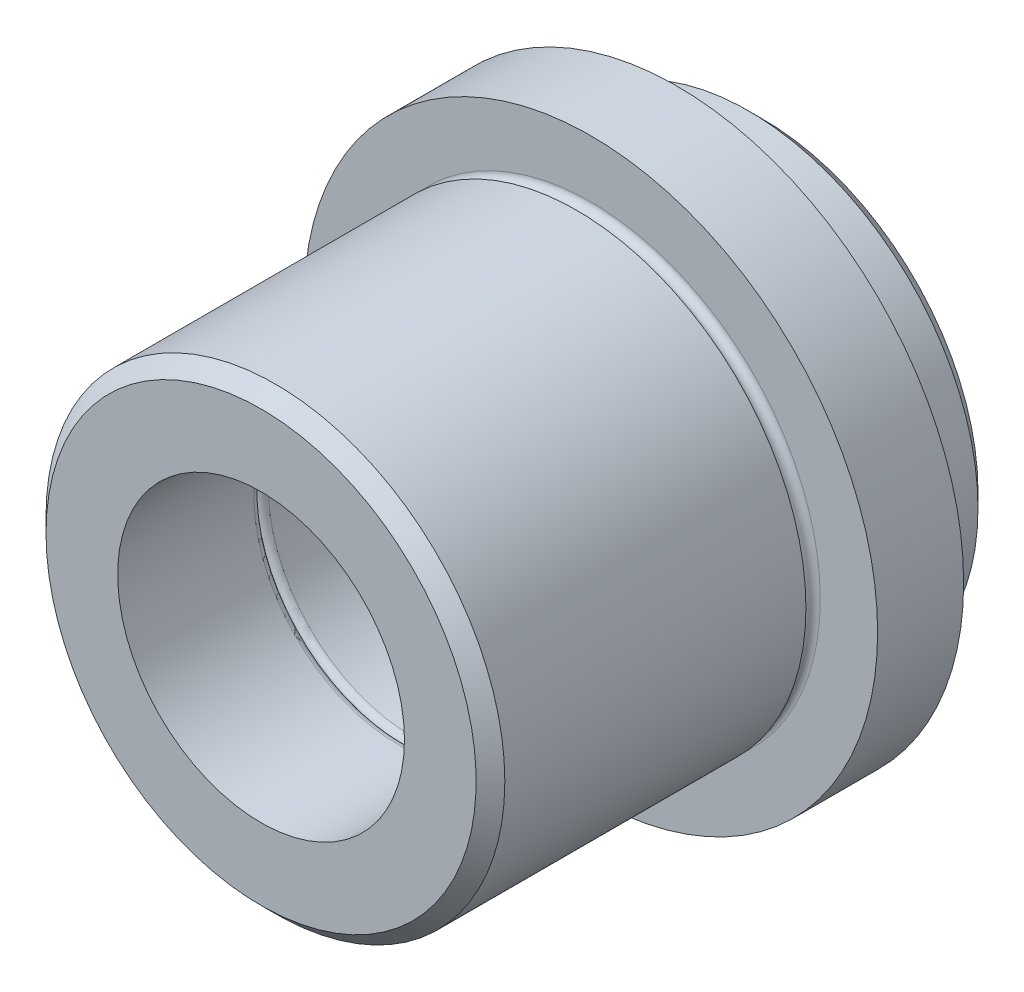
ISO-10303-21;
HEADER;
FILE_DESCRIPTION(('STEP AP214'),'2;1');
FILE_NAME('part.step','',(''),(''),'','','');
FILE_SCHEMA(('AUTOMOTIVE_DESIGN { 1 0 10303 214 1 1 1 1 }'));
ENDSEC;
DATA;
#1=APPLICATION_CONTEXT('core data for automotive mechanical design processes');
#2=APPLICATION_PROTOCOL_DEFINITION('international standard','automotive_design',2000,#1);
#3=PRODUCT_CONTEXT('',#1,'mechanical');
#4=PRODUCT('Part','Part','',(#3));
#5=PRODUCT_RELATED_PRODUCT_CATEGORY('part','',(#4));
#6=PRODUCT_DEFINITION_FORMATION('','',#4);
#7=PRODUCT_DEFINITION_CONTEXT('part definition',#1,'design');
#8=PRODUCT_DEFINITION('design','',#6,#7);
#9=PRODUCT_DEFINITION_SHAPE('','',#8);
#10=(LENGTH_UNIT() NAMED_UNIT(*) SI_UNIT(.MILLI.,.METRE.));
#11=(NAMED_UNIT(*) PLANE_ANGLE_UNIT() SI_UNIT($,.RADIAN.));
#12=(NAMED_UNIT(*) SI_UNIT($,.STERADIAN.) SOLID_ANGLE_UNIT());
#13=UNCERTAINTY_MEASURE_WITH_UNIT(LENGTH_MEASURE(1.E-05),#10,'distance_accuracy_value','');
#14=(GEOMETRIC_REPRESENTATION_CONTEXT(3) GLOBAL_UNCERTAINTY_ASSIGNED_CONTEXT((#13)) GLOBAL_UNIT_ASSIGNED_CONTEXT((#10,
#11,#12)) REPRESENTATION_CONTEXT('',''));
#15=CARTESIAN_POINT('',(0.,0.,0.));
#16=DIRECTION('',(0.,0.,1.));
#17=DIRECTION('',(1.,0.,0.));
#18=AXIS2_PLACEMENT_3D('',#15,#16,#17);
#19=CARTESIAN_POINT('',(0.,0.,0.));
#20=DIRECTION('',(0.,0.,1.));
#21=DIRECTION('',(1.,0.,0.));
#22=AXIS2_PLACEMENT_3D('',#19,#20,#21);
#23=CYLINDRICAL_SURFACE('',#22,10.);
#24=CARTESIAN_POINT('',(0.,0.,-9.5));
#25=DIRECTION('',(0.,0.,1.));
#26=DIRECTION('',(1.,0.,0.));
#27=AXIS2_PLACEMENT_3D('',#24,#25,#26);
#28=CIRCLE('',#27,10.);
#29=CARTESIAN_POINT('',(10.,0.,-9.5));
#30=VERTEX_POINT('',#29);
#31=EDGE_CURVE('E69',#30,#30,#28,.T.);
#32=ORIENTED_EDGE('',*,*,#31,.F.);
#33=EDGE_LOOP('',(#32));
#34=FACE_BOUND('',#33,.T.);
#35=CARTESIAN_POINT('',(0.,0.,0.));
#36=DIRECTION('',(0.,0.,1.));
#37=DIRECTION('',(1.,0.,0.));
#38=AXIS2_PLACEMENT_3D('',#35,#36,#37);
#39=CIRCLE('',#38,10.);
#40=CARTESIAN_POINT('',(10.,0.,0.));
#41=VERTEX_POINT('',#40);
#42=EDGE_CURVE('E33',#41,#41,#39,.T.);
#43=ORIENTED_EDGE('',*,*,#42,.T.);
#44=EDGE_LOOP('',(#43));
#45=FACE_BOUND('',#44,.T.);
#46=ADVANCED_FACE('F13',(#34,#45),#23,.F.);
#47=CARTESIAN_POINT('',(0.,10.,0.));
#48=DIRECTION('',(0.,0.,-1.));
#49=DIRECTION('',(-1.,0.,0.));
#50=AXIS2_PLACEMENT_3D('',#47,#48,#49);
#51=PLANE('',#50);
#52=CARTESIAN_POINT('',(0.,0.,0.));
#53=DIRECTION('',(0.,0.,-1.));
#54=DIRECTION('',(-1.,0.,0.));
#55=AXIS2_PLACEMENT_3D('',#52,#53,#54);
#56=CIRCLE('',#55,15.);
#57=CARTESIAN_POINT('',(-15.,0.,0.));
#58=VERTEX_POINT('',#57);
#59=EDGE_CURVE('E20',#58,#58,#56,.F.);
#60=ORIENTED_EDGE('',*,*,#59,.T.);
#61=EDGE_LOOP('',(#60));
#62=FACE_BOUND('',#61,.T.);
#63=ORIENTED_EDGE('',*,*,#42,.F.);
#64=EDGE_LOOP('',(#63));
#65=FACE_BOUND('',#64,.T.);
#66=ADVANCED_FACE('F77',(#62,#65),#51,.F.);
#67=CARTESIAN_POINT('',(0.,0.,0.));
#68=DIRECTION('',(0.,0.,1.));
#69=DIRECTION('',(1.,0.,0.));
#70=AXIS2_PLACEMENT_3D('',#67,#68,#69);
#71=CYLINDRICAL_SURFACE('',#70,16.);
#72=CARTESIAN_POINT('',(0.,0.,-1.00000000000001));
#73=DIRECTION('',(0.,0.,-1.));
#74=DIRECTION('',(-1.,0.,0.));
#75=AXIS2_PLACEMENT_3D('',#72,#73,#74);
#76=CIRCLE('',#75,16.);
#77=CARTESIAN_POINT('',(-16.,0.,-1.00000000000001));
#78=VERTEX_POINT('',#77);
#79=EDGE_CURVE('E8',#78,#78,#76,.T.);
#80=ORIENTED_EDGE('',*,*,#79,.T.);
#81=EDGE_LOOP('',(#80));
#82=FACE_BOUND('',#81,.T.);
#83=CARTESIAN_POINT('',(0.,0.,-22.));
#84=DIRECTION('',(0.,0.,1.));
#85=DIRECTION('',(1.,0.,0.));
#86=AXIS2_PLACEMENT_3D('',#83,#84,#85);
#87=CIRCLE('',#86,16.);
#88=CARTESIAN_POINT('',(16.,0.,-22.));
#89=VERTEX_POINT('',#88);
#90=EDGE_CURVE('E36',#89,#89,#87,.T.);
#91=ORIENTED_EDGE('',*,*,#90,.T.);
#92=EDGE_LOOP('',(#91));
#93=FACE_BOUND('',#92,.T.);
#94=ADVANCED_FACE('F82',(#82,#93),#71,.T.);
#95=CARTESIAN_POINT('',(0.,0.,-22.5));
#96=DIRECTION('',(0.,0.,1.));
#97=DIRECTION('',(1.,0.,0.));
#98=AXIS2_PLACEMENT_3D('',#95,#96,#97);
#99=TOROIDAL_SURFACE('',#98,16.,0.5);
#100=ORIENTED_EDGE('',*,*,#90,.F.);
#101=EDGE_LOOP('',(#100));
#102=FACE_BOUND('',#101,.T.);
#103=CARTESIAN_POINT('',(0.,0.,-23.));
#104=DIRECTION('',(0.,0.,1.));
#105=DIRECTION('',(1.,0.,0.));
#106=AXIS2_PLACEMENT_3D('',#103,#104,#105);
#107=CIRCLE('',#106,16.);
#108=CARTESIAN_POINT('',(16.,0.,-23.));
#109=VERTEX_POINT('',#108);
#110=EDGE_CURVE('E39',#109,#109,#107,.T.);
#111=ORIENTED_EDGE('',*,*,#110,.T.);
#112=EDGE_LOOP('',(#111));
#113=FACE_BOUND('',#112,.T.);
#114=ADVANCED_FACE('F89',(#102,#113),#99,.F.);
#115=CARTESIAN_POINT('',(0.,16.,-23.));
#116=DIRECTION('',(0.,0.,-1.));
#117=DIRECTION('',(-1.,0.,0.));
#118=AXIS2_PLACEMENT_3D('',#115,#116,#117);
#119=PLANE('',#118);
#120=ORIENTED_EDGE('',*,*,#110,.F.);
#121=EDGE_LOOP('',(#120));
#122=FACE_BOUND('',#121,.T.);
#123=CARTESIAN_POINT('',(0.,0.,-23.));
#124=DIRECTION('',(0.,0.,1.));
#125=DIRECTION('',(1.,0.,0.));
#126=AXIS2_PLACEMENT_3D('',#123,#124,#125);
#127=CIRCLE('',#126,20.);
#128=CARTESIAN_POINT('',(20.,0.,-23.));
#129=VERTEX_POINT('',#128);
#130=EDGE_CURVE('E42',#129,#129,#127,.T.);
#131=ORIENTED_EDGE('',*,*,#130,.T.);
#132=EDGE_LOOP('',(#131));
#133=FACE_BOUND('',#132,.T.);
#134=ADVANCED_FACE('F124',(#122,#133),#119,.F.);
#135=CARTESIAN_POINT('',(0.,0.,0.));
#136=DIRECTION('',(0.,0.,1.));
#137=DIRECTION('',(1.,0.,0.));
#138=AXIS2_PLACEMENT_3D('',#135,#136,#137);
#139=CYLINDRICAL_SURFACE('',#138,20.);
#140=ORIENTED_EDGE('',*,*,#130,.F.);
#141=EDGE_LOOP('',(#140));
#142=FACE_BOUND('',#141,.T.);
#143=CARTESIAN_POINT('',(0.,0.,-29.));
#144=DIRECTION('',(0.,0.,1.));
#145=DIRECTION('',(1.,0.,0.));
#146=AXIS2_PLACEMENT_3D('',#143,#144,#145);
#147=CIRCLE('',#146,20.);
#148=CARTESIAN_POINT('',(20.,0.,-29.));
#149=VERTEX_POINT('',#148);
#150=EDGE_CURVE('E45',#149,#149,#147,.T.);
#151=ORIENTED_EDGE('',*,*,#150,.T.);
#152=EDGE_LOOP('',(#151));
#153=FACE_BOUND('',#152,.T.);
#154=ADVANCED_FACE('F117',(#142,#153),#139,.T.);
#155=CARTESIAN_POINT('',(0.,20.,-29.));
#156=DIRECTION('',(0.,0.,1.));
#157=DIRECTION('',(1.,0.,0.));
#158=AXIS2_PLACEMENT_3D('',#155,#156,#157);
#159=PLANE('',#158);
#160=ORIENTED_EDGE('',*,*,#150,.F.);
#161=EDGE_LOOP('',(#160));
#162=FACE_BOUND('',#161,.T.);
#163=CARTESIAN_POINT('',(0.,0.,-29.));
#164=DIRECTION('',(0.,0.,1.));
#165=DIRECTION('',(1.,0.,0.));
#166=AXIS2_PLACEMENT_3D('',#163,#164,#165);
#167=CIRCLE('',#166,16.);
#168=CARTESIAN_POINT('',(16.,0.,-29.));
#169=VERTEX_POINT('',#168);
#170=EDGE_CURVE('E48',#169,#169,#167,.T.);
#171=ORIENTED_EDGE('',*,*,#170,.T.);
#172=EDGE_LOOP('',(#171));
#173=FACE_BOUND('',#172,.T.);
#174=ADVANCED_FACE('F112',(#162,#173),#159,.F.);
#175=CARTESIAN_POINT('',(0.,0.,0.));
#176=DIRECTION('',(0.,0.,1.));
#177=DIRECTION('',(1.,0.,0.));
#178=AXIS2_PLACEMENT_3D('',#175,#176,#177);
#179=CYLINDRICAL_SURFACE('',#178,16.);
#180=CARTESIAN_POINT('',(0.,0.,-34.));
#181=DIRECTION('',(0.,0.,1.));
#182=DIRECTION('',(1.,0.,0.));
#183=AXIS2_PLACEMENT_3D('',#180,#181,#182);
#184=CIRCLE('',#183,16.);
#185=CARTESIAN_POINT('',(16.,0.,-34.));
#186=VERTEX_POINT('',#185);
#187=EDGE_CURVE('E28',#186,#186,#184,.T.);
#188=ORIENTED_EDGE('',*,*,#187,.T.);
#189=EDGE_LOOP('',(#188));
#190=FACE_BOUND('',#189,.T.);
#191=ORIENTED_EDGE('',*,*,#170,.F.);
#192=EDGE_LOOP('',(#191));
#193=FACE_BOUND('',#192,.T.);
#194=ADVANCED_FACE('F108',(#190,#193),#179,.T.);
#195=CARTESIAN_POINT('',(0.,16.,-35.));
#196=DIRECTION('',(0.,0.,1.));
#197=DIRECTION('',(1.,0.,0.));
#198=AXIS2_PLACEMENT_3D('',#195,#196,#197);
#199=PLANE('',#198);
#200=CARTESIAN_POINT('',(0.,0.,-35.));
#201=DIRECTION('',(0.,0.,1.));
#202=DIRECTION('',(1.,0.,0.));
#203=AXIS2_PLACEMENT_3D('',#200,#201,#202);
#204=CIRCLE('',#203,15.);
#205=CARTESIAN_POINT('',(15.,0.,-35.));
#206=VERTEX_POINT('',#205);
#207=EDGE_CURVE('E24',#206,#206,#204,.F.);
#208=ORIENTED_EDGE('',*,*,#207,.T.);
#209=EDGE_LOOP('',(#208));
#210=FACE_BOUND('',#209,.T.);
#211=CARTESIAN_POINT('',(0.,0.,-35.));
#212=DIRECTION('',(0.,0.,1.));
#213=DIRECTION('',(1.,0.,0.));
#214=AXIS2_PLACEMENT_3D('',#211,#212,#213);
#215=CIRCLE('',#214,10.);
#216=CARTESIAN_POINT('',(10.,0.,-35.));
#217=VERTEX_POINT('',#216);
#218=EDGE_CURVE('E51',#217,#217,#215,.T.);
#219=ORIENTED_EDGE('',*,*,#218,.T.);
#220=EDGE_LOOP('',(#219));
#221=FACE_BOUND('',#220,.T.);
#222=ADVANCED_FACE('F111',(#210,#221),#199,.F.);
#223=CARTESIAN_POINT('',(0.,0.,0.));
#224=DIRECTION('',(0.,0.,1.));
#225=DIRECTION('',(1.,0.,0.));
#226=AXIS2_PLACEMENT_3D('',#223,#224,#225);
#227=CYLINDRICAL_SURFACE('',#226,10.);
#228=ORIENTED_EDGE('',*,*,#218,.F.);
#229=EDGE_LOOP('',(#228));
#230=FACE_BOUND('',#229,.T.);
#231=CARTESIAN_POINT('',(0.,0.,-22.5));
#232=DIRECTION('',(0.,0.,1.));
#233=DIRECTION('',(1.,0.,0.));
#234=AXIS2_PLACEMENT_3D('',#231,#232,#233);
#235=CIRCLE('',#234,10.);
#236=CARTESIAN_POINT('',(10.,0.,-22.5));
#237=VERTEX_POINT('',#236);
#238=EDGE_CURVE('E54',#237,#237,#235,.T.);
#239=ORIENTED_EDGE('',*,*,#238,.T.);
#240=EDGE_LOOP('',(#239));
#241=FACE_BOUND('',#240,.T.);
#242=ADVANCED_FACE('F240',(#230,#241),#227,.F.);
#243=CARTESIAN_POINT('',(0.,0.,-22.5));
#244=DIRECTION('',(0.,0.,1.));
#245=DIRECTION('',(1.,0.,0.));
#246=AXIS2_PLACEMENT_3D('',#243,#244,#245);
#247=TOROIDAL_SURFACE('',#246,10.5,0.5);
#248=ORIENTED_EDGE('',*,*,#238,.F.);
#249=EDGE_LOOP('',(#248));
#250=FACE_BOUND('',#249,.T.);
#251=CARTESIAN_POINT('',(0.,0.,-22.));
#252=DIRECTION('',(0.,0.,1.));
#253=DIRECTION('',(1.,0.,0.));
#254=AXIS2_PLACEMENT_3D('',#251,#252,#253);
#255=CIRCLE('',#254,10.5);
#256=CARTESIAN_POINT('',(10.5,0.,-22.));
#257=VERTEX_POINT('',#256);
#258=EDGE_CURVE('E57',#257,#257,#255,.T.);
#259=ORIENTED_EDGE('',*,*,#258,.T.);
#260=EDGE_LOOP('',(#259));
#261=FACE_BOUND('',#260,.T.);
#262=ADVANCED_FACE('F231',(#250,#261),#247,.T.);
#263=CARTESIAN_POINT('',(0.,0.,-21.5));
#264=DIRECTION('',(0.,0.,1.));
#265=DIRECTION('',(1.,0.,0.));
#266=AXIS2_PLACEMENT_3D('',#263,#264,#265);
#267=TOROIDAL_SURFACE('',#266,10.5,0.5);
#268=ORIENTED_EDGE('',*,*,#258,.F.);
#269=EDGE_LOOP('',(#268));
#270=FACE_BOUND('',#269,.T.);
#271=CARTESIAN_POINT('',(0.,0.,-21.5));
#272=DIRECTION('',(0.,0.,1.));
#273=DIRECTION('',(1.,0.,0.));
#274=AXIS2_PLACEMENT_3D('',#271,#272,#273);
#275=CIRCLE('',#274,10.);
#276=CARTESIAN_POINT('',(10.,0.,-21.5));
#277=VERTEX_POINT('',#276);
#278=EDGE_CURVE('E60',#277,#277,#275,.T.);
#279=ORIENTED_EDGE('',*,*,#278,.T.);
#280=EDGE_LOOP('',(#279));
#281=FACE_BOUND('',#280,.T.);
#282=ADVANCED_FACE('F222',(#270,#281),#267,.T.);
#283=CARTESIAN_POINT('',(0.,0.,0.));
#284=DIRECTION('',(0.,0.,1.));
#285=DIRECTION('',(1.,0.,0.));
#286=AXIS2_PLACEMENT_3D('',#283,#284,#285);
#287=CYLINDRICAL_SURFACE('',#286,10.);
#288=ORIENTED_EDGE('',*,*,#278,.F.);
#289=EDGE_LOOP('',(#288));
#290=FACE_BOUND('',#289,.T.);
#291=CARTESIAN_POINT('',(0.,0.,-10.5));
#292=DIRECTION('',(0.,0.,1.));
#293=DIRECTION('',(1.,0.,0.));
#294=AXIS2_PLACEMENT_3D('',#291,#292,#293);
#295=CIRCLE('',#294,10.);
#296=CARTESIAN_POINT('',(10.,0.,-10.5));
#297=VERTEX_POINT('',#296);
#298=EDGE_CURVE('E63',#297,#297,#295,.T.);
#299=ORIENTED_EDGE('',*,*,#298,.T.);
#300=EDGE_LOOP('',(#299));
#301=FACE_BOUND('',#300,.T.);
#302=ADVANCED_FACE('F214',(#290,#301),#287,.F.);
#303=CARTESIAN_POINT('',(0.,0.,-10.5));
#304=DIRECTION('',(0.,0.,1.));
#305=DIRECTION('',(1.,0.,0.));
#306=AXIS2_PLACEMENT_3D('',#303,#304,#305);
#307=TOROIDAL_SURFACE('',#306,10.5,0.5);
#308=ORIENTED_EDGE('',*,*,#298,.F.);
#309=EDGE_LOOP('',(#308));
#310=FACE_BOUND('',#309,.T.);
#311=CARTESIAN_POINT('',(0.,0.,-10.));
#312=DIRECTION('',(0.,0.,1.));
#313=DIRECTION('',(1.,0.,0.));
#314=AXIS2_PLACEMENT_3D('',#311,#312,#313);
#315=CIRCLE('',#314,10.5);
#316=CARTESIAN_POINT('',(10.5,0.,-10.));
#317=VERTEX_POINT('',#316);
#318=EDGE_CURVE('E66',#317,#317,#315,.T.);
#319=ORIENTED_EDGE('',*,*,#318,.T.);
#320=EDGE_LOOP('',(#319));
#321=FACE_BOUND('',#320,.T.);
#322=ADVANCED_FACE('F101',(#310,#321),#307,.T.);
#323=CARTESIAN_POINT('',(0.,0.,-9.5));
#324=DIRECTION('',(0.,0.,1.));
#325=DIRECTION('',(1.,0.,0.));
#326=AXIS2_PLACEMENT_3D('',#323,#324,#325);
#327=TOROIDAL_SURFACE('',#326,10.5,0.5);
#328=ORIENTED_EDGE('',*,*,#318,.F.);
#329=EDGE_LOOP('',(#328));
#330=FACE_BOUND('',#329,.T.);
#331=ORIENTED_EDGE('',*,*,#31,.T.);
#332=EDGE_LOOP('',(#331));
#333=FACE_BOUND('',#332,.T.);
#334=ADVANCED_FACE('F73',(#330,#333),#327,.T.);
#335=CARTESIAN_POINT('',(0.,0.,-34.));
#336=DIRECTION('',(0.,0.,1.));
#337=DIRECTION('',(1.,0.,0.));
#338=AXIS2_PLACEMENT_3D('',#335,#336,#337);
#339=CONICAL_SURFACE('',#338,16.,0.785398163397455);
#340=ORIENTED_EDGE('',*,*,#207,.F.);
#341=EDGE_LOOP('',(#340));
#342=FACE_BOUND('',#341,.T.);
#343=ORIENTED_EDGE('',*,*,#187,.F.);
#344=EDGE_LOOP('',(#343));
#345=FACE_BOUND('',#344,.T.);
#346=ADVANCED_FACE('F92',(#342,#345),#339,.T.);
#347=CARTESIAN_POINT('',(0.,0.,0.));
#348=DIRECTION('',(0.,0.,-1.));
#349=DIRECTION('',(-1.,0.,0.));
#350=AXIS2_PLACEMENT_3D('',#347,#348,#349);
#351=CONICAL_SURFACE('',#350,15.,0.785398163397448);
#352=ORIENTED_EDGE('',*,*,#79,.F.);
#353=EDGE_LOOP('',(#352));
#354=FACE_BOUND('',#353,.T.);
#355=ORIENTED_EDGE('',*,*,#59,.F.);
#356=EDGE_LOOP('',(#355));
#357=FACE_BOUND('',#356,.T.);
#358=ADVANCED_FACE('F15',(#354,#357),#351,.T.);
#359=CLOSED_SHELL('',(#46,#66,#94,#114,#134,#154,#174,#194,#222,#242,#262,#282,#302,#322,#334,
#346,#358));
#360=MANIFOLD_SOLID_BREP('B1',#359);
#361=ADVANCED_BREP_SHAPE_REPRESENTATION('',(#18,#360),#14);
#362=SHAPE_DEFINITION_REPRESENTATION(#9,#361);
ENDSEC;
END-ISO-10303-21;
